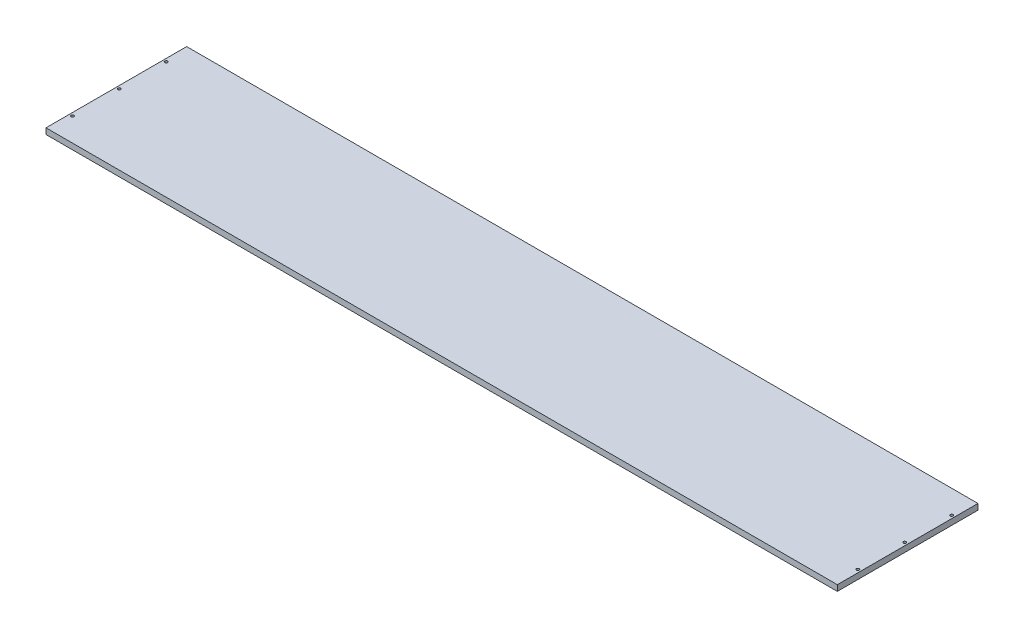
ISO-10303-21;
HEADER;
FILE_DESCRIPTION(('STEP AP214'),'2;1');
FILE_NAME('part.step','',(''),(''),'','','');
FILE_SCHEMA(('AUTOMOTIVE_DESIGN { 1 0 10303 214 1 1 1 1 }'));
ENDSEC;
DATA;
#1=APPLICATION_CONTEXT('core data for automotive mechanical design processes');
#2=APPLICATION_PROTOCOL_DEFINITION('international standard','automotive_design',2000,#1);
#3=PRODUCT_CONTEXT('',#1,'mechanical');
#4=PRODUCT('Part','Part','',(#3));
#5=PRODUCT_RELATED_PRODUCT_CATEGORY('part','',(#4));
#6=PRODUCT_DEFINITION_FORMATION('','',#4);
#7=PRODUCT_DEFINITION_CONTEXT('part definition',#1,'design');
#8=PRODUCT_DEFINITION('design','',#6,#7);
#9=PRODUCT_DEFINITION_SHAPE('','',#8);
#10=(LENGTH_UNIT() NAMED_UNIT(*) SI_UNIT(.MILLI.,.METRE.));
#11=(NAMED_UNIT(*) PLANE_ANGLE_UNIT() SI_UNIT($,.RADIAN.));
#12=(NAMED_UNIT(*) SI_UNIT($,.STERADIAN.) SOLID_ANGLE_UNIT());
#13=UNCERTAINTY_MEASURE_WITH_UNIT(LENGTH_MEASURE(1.E-05),#10,'distance_accuracy_value','');
#14=(GEOMETRIC_REPRESENTATION_CONTEXT(3) GLOBAL_UNCERTAINTY_ASSIGNED_CONTEXT((#13)) GLOBAL_UNIT_ASSIGNED_CONTEXT((#10,
#11,#12)) REPRESENTATION_CONTEXT('',''));
#15=CARTESIAN_POINT('',(0.,0.,0.));
#16=DIRECTION('',(0.,0.,1.));
#17=DIRECTION('',(1.,0.,0.));
#18=AXIS2_PLACEMENT_3D('',#15,#16,#17);
#19=CARTESIAN_POINT('',(428.625,6.35,76.2));
#20=DIRECTION('',(-1.,0.,0.));
#21=DIRECTION('',(0.,0.,1.));
#22=AXIS2_PLACEMENT_3D('',#19,#20,#21);
#23=PLANE('',#22);
#24=DIRECTION('',(0.,0.,-1.));
#25=VECTOR('',#24,1.);
#26=CARTESIAN_POINT('',(428.625,0.,76.2));
#27=LINE('',#26,#25);
#28=CARTESIAN_POINT('',(428.625,0.,76.2));
#29=VERTEX_POINT('',#28);
#30=CARTESIAN_POINT('',(428.625,0.,-76.2));
#31=VERTEX_POINT('',#30);
#32=EDGE_CURVE('E100',#29,#31,#27,.T.);
#33=ORIENTED_EDGE('',*,*,#32,.T.);
#34=DIRECTION('',(0.,-1.,0.));
#35=VECTOR('',#34,1.);
#36=CARTESIAN_POINT('',(428.625,6.35,-76.2));
#37=LINE('',#36,#35);
#38=CARTESIAN_POINT('',(428.625,6.35,-76.2));
#39=VERTEX_POINT('',#38);
#40=EDGE_CURVE('E11',#39,#31,#37,.T.);
#41=ORIENTED_EDGE('',*,*,#40,.F.);
#42=DIRECTION('',(0.,0.,-1.));
#43=VECTOR('',#42,1.);
#44=CARTESIAN_POINT('',(428.625,6.35,76.2));
#45=LINE('',#44,#43);
#46=CARTESIAN_POINT('',(428.625,6.35,76.2));
#47=VERTEX_POINT('',#46);
#48=EDGE_CURVE('E88',#47,#39,#45,.T.);
#49=ORIENTED_EDGE('',*,*,#48,.F.);
#50=DIRECTION('',(0.,-1.,0.));
#51=VECTOR('',#50,1.);
#52=CARTESIAN_POINT('',(428.625,6.35,76.2));
#53=LINE('',#52,#51);
#54=EDGE_CURVE('E96',#47,#29,#53,.T.);
#55=ORIENTED_EDGE('',*,*,#54,.T.);
#56=EDGE_LOOP('',(#33,#41,#49,#55));
#57=FACE_BOUND('',#56,.T.);
#58=ADVANCED_FACE('F37',(#57),#23,.F.);
#59=CARTESIAN_POINT('',(-428.625,6.35,-76.2));
#60=DIRECTION('',(0.,0.,1.));
#61=DIRECTION('',(1.,0.,0.));
#62=AXIS2_PLACEMENT_3D('',#59,#60,#61);
#63=PLANE('',#62);
#64=DIRECTION('',(-1.,0.,0.));
#65=VECTOR('',#64,1.);
#66=CARTESIAN_POINT('',(-428.625,0.,-76.2));
#67=LINE('',#66,#65);
#68=CARTESIAN_POINT('',(-428.625,0.,-76.2));
#69=VERTEX_POINT('',#68);
#70=EDGE_CURVE('E92',#31,#69,#67,.T.);
#71=ORIENTED_EDGE('',*,*,#70,.T.);
#72=DIRECTION('',(0.,-1.,0.));
#73=VECTOR('',#72,1.);
#74=CARTESIAN_POINT('',(-428.625,6.35,-76.2));
#75=LINE('',#74,#73);
#76=CARTESIAN_POINT('',(-428.625,6.35,-76.2));
#77=VERTEX_POINT('',#76);
#78=EDGE_CURVE('E45',#77,#69,#75,.T.);
#79=ORIENTED_EDGE('',*,*,#78,.F.);
#80=DIRECTION('',(-1.,0.,0.));
#81=VECTOR('',#80,1.);
#82=CARTESIAN_POINT('',(-428.625,6.35,-76.2));
#83=LINE('',#82,#81);
#84=EDGE_CURVE('E83',#39,#77,#83,.T.);
#85=ORIENTED_EDGE('',*,*,#84,.F.);
#86=ORIENTED_EDGE('',*,*,#40,.T.);
#87=EDGE_LOOP('',(#71,#79,#85,#86));
#88=FACE_BOUND('',#87,.T.);
#89=ADVANCED_FACE('F91',(#88),#63,.F.);
#90=CARTESIAN_POINT('',(-428.625,6.35,76.2));
#91=DIRECTION('',(1.,0.,0.));
#92=DIRECTION('',(0.,0.,-1.));
#93=AXIS2_PLACEMENT_3D('',#90,#91,#92);
#94=PLANE('',#93);
#95=DIRECTION('',(0.,0.,1.));
#96=VECTOR('',#95,1.);
#97=CARTESIAN_POINT('',(-428.625,0.,76.2));
#98=LINE('',#97,#96);
#99=CARTESIAN_POINT('',(-428.625,0.,76.2));
#100=VERTEX_POINT('',#99);
#101=EDGE_CURVE('E70',#69,#100,#98,.T.);
#102=ORIENTED_EDGE('',*,*,#101,.T.);
#103=DIRECTION('',(0.,-1.,0.));
#104=VECTOR('',#103,1.);
#105=CARTESIAN_POINT('',(-428.625,6.35,76.2));
#106=LINE('',#105,#104);
#107=CARTESIAN_POINT('',(-428.625,6.35,76.2));
#108=VERTEX_POINT('',#107);
#109=EDGE_CURVE('E93',#108,#100,#106,.T.);
#110=ORIENTED_EDGE('',*,*,#109,.F.);
#111=DIRECTION('',(0.,0.,1.));
#112=VECTOR('',#111,1.);
#113=CARTESIAN_POINT('',(-428.625,6.35,76.2));
#114=LINE('',#113,#112);
#115=EDGE_CURVE('E86',#77,#108,#114,.T.);
#116=ORIENTED_EDGE('',*,*,#115,.F.);
#117=ORIENTED_EDGE('',*,*,#78,.T.);
#118=EDGE_LOOP('',(#102,#110,#116,#117));
#119=FACE_BOUND('',#118,.T.);
#120=ADVANCED_FACE('F94',(#119),#94,.F.);
#121=CARTESIAN_POINT('',(-428.625,6.35,76.2));
#122=DIRECTION('',(0.,0.,-1.));
#123=DIRECTION('',(-1.,0.,0.));
#124=AXIS2_PLACEMENT_3D('',#121,#122,#123);
#125=PLANE('',#124);
#126=DIRECTION('',(1.,0.,0.));
#127=VECTOR('',#126,1.);
#128=CARTESIAN_POINT('',(-428.625,0.,76.2));
#129=LINE('',#128,#127);
#130=EDGE_CURVE('E76',#100,#29,#129,.T.);
#131=ORIENTED_EDGE('',*,*,#130,.T.);
#132=ORIENTED_EDGE('',*,*,#54,.F.);
#133=DIRECTION('',(1.,0.,0.));
#134=VECTOR('',#133,1.);
#135=CARTESIAN_POINT('',(-428.625,6.35,76.2));
#136=LINE('',#135,#134);
#137=EDGE_CURVE('E53',#108,#47,#136,.T.);
#138=ORIENTED_EDGE('',*,*,#137,.F.);
#139=ORIENTED_EDGE('',*,*,#109,.T.);
#140=EDGE_LOOP('',(#131,#132,#138,#139));
#141=FACE_BOUND('',#140,.T.);
#142=ADVANCED_FACE('F108',(#141),#125,.F.);
#143=CARTESIAN_POINT('',(0.,6.35,0.));
#144=DIRECTION('',(0.,-1.,0.));
#145=DIRECTION('',(0.,0.,-1.));
#146=AXIS2_PLACEMENT_3D('',#143,#144,#145);
#147=PLANE('',#146);
#148=CARTESIAN_POINT('',(425.45,6.35,0.));
#149=DIRECTION('',(0.,1.,0.));
#150=DIRECTION('',(0.,0.,1.));
#151=AXIS2_PLACEMENT_3D('',#148,#149,#150);
#152=CIRCLE('',#151,1.52399999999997);
#153=CARTESIAN_POINT('',(425.45,6.35,1.52399999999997));
#154=VERTEX_POINT('',#153);
#155=EDGE_CURVE('E146',#154,#154,#152,.T.);
#156=ORIENTED_EDGE('',*,*,#155,.F.);
#157=EDGE_LOOP('',(#156));
#158=FACE_BOUND('',#157,.T.);
#159=CARTESIAN_POINT('',(425.45,6.35,-50.8));
#160=DIRECTION('',(0.,1.,0.));
#161=DIRECTION('',(0.,0.,1.));
#162=AXIS2_PLACEMENT_3D('',#159,#160,#161);
#163=CIRCLE('',#162,1.52399999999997);
#164=CARTESIAN_POINT('',(425.45,6.35,-49.276));
#165=VERTEX_POINT('',#164);
#166=EDGE_CURVE('E140',#165,#165,#163,.T.);
#167=ORIENTED_EDGE('',*,*,#166,.F.);
#168=EDGE_LOOP('',(#167));
#169=FACE_BOUND('',#168,.T.);
#170=CARTESIAN_POINT('',(425.45,6.35,50.8));
#171=DIRECTION('',(0.,1.,0.));
#172=DIRECTION('',(0.,0.,1.));
#173=AXIS2_PLACEMENT_3D('',#170,#171,#172);
#174=CIRCLE('',#173,1.52399999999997);
#175=CARTESIAN_POINT('',(425.45,6.35,52.324));
#176=VERTEX_POINT('',#175);
#177=EDGE_CURVE('E134',#176,#176,#174,.T.);
#178=ORIENTED_EDGE('',*,*,#177,.F.);
#179=EDGE_LOOP('',(#178));
#180=FACE_BOUND('',#179,.T.);
#181=CARTESIAN_POINT('',(-425.45,6.35,0.));
#182=DIRECTION('',(0.,1.,0.));
#183=DIRECTION('',(0.,0.,1.));
#184=AXIS2_PLACEMENT_3D('',#181,#182,#183);
#185=CIRCLE('',#184,1.52399999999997);
#186=CARTESIAN_POINT('',(-425.45,6.35,1.52399999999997));
#187=VERTEX_POINT('',#186);
#188=EDGE_CURVE('E128',#187,#187,#185,.T.);
#189=ORIENTED_EDGE('',*,*,#188,.F.);
#190=EDGE_LOOP('',(#189));
#191=FACE_BOUND('',#190,.T.);
#192=CARTESIAN_POINT('',(-425.45,6.35,50.8));
#193=DIRECTION('',(0.,1.,0.));
#194=DIRECTION('',(0.,0.,1.));
#195=AXIS2_PLACEMENT_3D('',#192,#193,#194);
#196=CIRCLE('',#195,1.52399999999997);
#197=CARTESIAN_POINT('',(-425.45,6.35,52.324));
#198=VERTEX_POINT('',#197);
#199=EDGE_CURVE('E122',#198,#198,#196,.T.);
#200=ORIENTED_EDGE('',*,*,#199,.F.);
#201=EDGE_LOOP('',(#200));
#202=FACE_BOUND('',#201,.T.);
#203=CARTESIAN_POINT('',(-425.45,6.35,-50.8));
#204=DIRECTION('',(0.,1.,0.));
#205=DIRECTION('',(0.,0.,1.));
#206=AXIS2_PLACEMENT_3D('',#203,#204,#205);
#207=CIRCLE('',#206,1.52399999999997);
#208=CARTESIAN_POINT('',(-425.45,6.35,-49.276));
#209=VERTEX_POINT('',#208);
#210=EDGE_CURVE('E116',#209,#209,#207,.T.);
#211=ORIENTED_EDGE('',*,*,#210,.F.);
#212=EDGE_LOOP('',(#211));
#213=FACE_BOUND('',#212,.T.);
#214=ORIENTED_EDGE('',*,*,#48,.T.);
#215=ORIENTED_EDGE('',*,*,#84,.T.);
#216=ORIENTED_EDGE('',*,*,#115,.T.);
#217=ORIENTED_EDGE('',*,*,#137,.T.);
#218=EDGE_LOOP('',(#214,#215,#216,#217));
#219=FACE_BOUND('',#218,.T.);
#220=ADVANCED_FACE('F84',(#158,#169,#180,#191,#202,#213,#219),#147,.F.);
#221=CARTESIAN_POINT('',(0.,0.,0.));
#222=DIRECTION('',(0.,-1.,0.));
#223=DIRECTION('',(0.,0.,-1.));
#224=AXIS2_PLACEMENT_3D('',#221,#222,#223);
#225=PLANE('',#224);
#226=CARTESIAN_POINT('',(425.45,0.,0.));
#227=DIRECTION('',(0.,1.,0.));
#228=DIRECTION('',(0.,0.,1.));
#229=AXIS2_PLACEMENT_3D('',#226,#227,#228);
#230=CIRCLE('',#229,1.52400000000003);
#231=CARTESIAN_POINT('',(425.45,0.,1.52400000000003));
#232=VERTEX_POINT('',#231);
#233=EDGE_CURVE('E143',#232,#232,#230,.T.);
#234=ORIENTED_EDGE('',*,*,#233,.T.);
#235=EDGE_LOOP('',(#234));
#236=FACE_BOUND('',#235,.T.);
#237=CARTESIAN_POINT('',(425.45,0.,-50.8));
#238=DIRECTION('',(0.,1.,0.));
#239=DIRECTION('',(0.,0.,1.));
#240=AXIS2_PLACEMENT_3D('',#237,#238,#239);
#241=CIRCLE('',#240,1.52400000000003);
#242=CARTESIAN_POINT('',(425.45,0.,-49.276));
#243=VERTEX_POINT('',#242);
#244=EDGE_CURVE('E137',#243,#243,#241,.T.);
#245=ORIENTED_EDGE('',*,*,#244,.T.);
#246=EDGE_LOOP('',(#245));
#247=FACE_BOUND('',#246,.T.);
#248=CARTESIAN_POINT('',(425.45,0.,50.8));
#249=DIRECTION('',(0.,1.,0.));
#250=DIRECTION('',(0.,0.,1.));
#251=AXIS2_PLACEMENT_3D('',#248,#249,#250);
#252=CIRCLE('',#251,1.52400000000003);
#253=CARTESIAN_POINT('',(425.45,0.,52.324));
#254=VERTEX_POINT('',#253);
#255=EDGE_CURVE('E131',#254,#254,#252,.T.);
#256=ORIENTED_EDGE('',*,*,#255,.T.);
#257=EDGE_LOOP('',(#256));
#258=FACE_BOUND('',#257,.T.);
#259=CARTESIAN_POINT('',(-425.45,0.,0.));
#260=DIRECTION('',(0.,1.,0.));
#261=DIRECTION('',(0.,0.,1.));
#262=AXIS2_PLACEMENT_3D('',#259,#260,#261);
#263=CIRCLE('',#262,1.52400000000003);
#264=CARTESIAN_POINT('',(-425.45,0.,1.52400000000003));
#265=VERTEX_POINT('',#264);
#266=EDGE_CURVE('E125',#265,#265,#263,.T.);
#267=ORIENTED_EDGE('',*,*,#266,.T.);
#268=EDGE_LOOP('',(#267));
#269=FACE_BOUND('',#268,.T.);
#270=CARTESIAN_POINT('',(-425.45,0.,50.8));
#271=DIRECTION('',(0.,1.,0.));
#272=DIRECTION('',(0.,0.,1.));
#273=AXIS2_PLACEMENT_3D('',#270,#271,#272);
#274=CIRCLE('',#273,1.52400000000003);
#275=CARTESIAN_POINT('',(-425.45,0.,52.324));
#276=VERTEX_POINT('',#275);
#277=EDGE_CURVE('E119',#276,#276,#274,.T.);
#278=ORIENTED_EDGE('',*,*,#277,.T.);
#279=EDGE_LOOP('',(#278));
#280=FACE_BOUND('',#279,.T.);
#281=CARTESIAN_POINT('',(-425.45,0.,-50.8));
#282=DIRECTION('',(0.,1.,0.));
#283=DIRECTION('',(0.,0.,1.));
#284=AXIS2_PLACEMENT_3D('',#281,#282,#283);
#285=CIRCLE('',#284,1.52400000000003);
#286=CARTESIAN_POINT('',(-425.45,0.,-49.276));
#287=VERTEX_POINT('',#286);
#288=EDGE_CURVE('E103',#287,#287,#285,.T.);
#289=ORIENTED_EDGE('',*,*,#288,.T.);
#290=EDGE_LOOP('',(#289));
#291=FACE_BOUND('',#290,.T.);
#292=ORIENTED_EDGE('',*,*,#32,.F.);
#293=ORIENTED_EDGE('',*,*,#130,.F.);
#294=ORIENTED_EDGE('',*,*,#101,.F.);
#295=ORIENTED_EDGE('',*,*,#70,.F.);
#296=EDGE_LOOP('',(#292,#293,#294,#295));
#297=FACE_BOUND('',#296,.T.);
#298=ADVANCED_FACE('F111',(#236,#247,#258,#269,#280,#291,#297),#225,.T.);
#299=CARTESIAN_POINT('',(-425.45,6.35,-50.8));
#300=DIRECTION('',(0.,1.,0.));
#301=DIRECTION('',(0.,0.,1.));
#302=AXIS2_PLACEMENT_3D('',#299,#300,#301);
#303=CYLINDRICAL_SURFACE('',#302,1.524);
#304=ORIENTED_EDGE('',*,*,#288,.F.);
#305=EDGE_LOOP('',(#304));
#306=FACE_BOUND('',#305,.T.);
#307=ORIENTED_EDGE('',*,*,#210,.T.);
#308=EDGE_LOOP('',(#307));
#309=FACE_BOUND('',#308,.T.);
#310=ADVANCED_FACE('F165',(#306,#309),#303,.F.);
#311=CARTESIAN_POINT('',(-425.45,6.35,50.8));
#312=DIRECTION('',(0.,1.,0.));
#313=DIRECTION('',(0.,0.,1.));
#314=AXIS2_PLACEMENT_3D('',#311,#312,#313);
#315=CYLINDRICAL_SURFACE('',#314,1.524);
#316=ORIENTED_EDGE('',*,*,#277,.F.);
#317=EDGE_LOOP('',(#316));
#318=FACE_BOUND('',#317,.T.);
#319=ORIENTED_EDGE('',*,*,#199,.T.);
#320=EDGE_LOOP('',(#319));
#321=FACE_BOUND('',#320,.T.);
#322=ADVANCED_FACE('F167',(#318,#321),#315,.F.);
#323=CARTESIAN_POINT('',(-425.45,6.35,0.));
#324=DIRECTION('',(0.,1.,0.));
#325=DIRECTION('',(0.,0.,1.));
#326=AXIS2_PLACEMENT_3D('',#323,#324,#325);
#327=CYLINDRICAL_SURFACE('',#326,1.524);
#328=ORIENTED_EDGE('',*,*,#266,.F.);
#329=EDGE_LOOP('',(#328));
#330=FACE_BOUND('',#329,.T.);
#331=ORIENTED_EDGE('',*,*,#188,.T.);
#332=EDGE_LOOP('',(#331));
#333=FACE_BOUND('',#332,.T.);
#334=ADVANCED_FACE('F174',(#330,#333),#327,.F.);
#335=CARTESIAN_POINT('',(425.45,6.35,50.8));
#336=DIRECTION('',(0.,1.,0.));
#337=DIRECTION('',(0.,0.,1.));
#338=AXIS2_PLACEMENT_3D('',#335,#336,#337);
#339=CYLINDRICAL_SURFACE('',#338,1.524);
#340=ORIENTED_EDGE('',*,*,#255,.F.);
#341=EDGE_LOOP('',(#340));
#342=FACE_BOUND('',#341,.T.);
#343=ORIENTED_EDGE('',*,*,#177,.T.);
#344=EDGE_LOOP('',(#343));
#345=FACE_BOUND('',#344,.T.);
#346=ADVANCED_FACE('F224',(#342,#345),#339,.F.);
#347=CARTESIAN_POINT('',(425.45,6.35,-50.8));
#348=DIRECTION('',(0.,1.,0.));
#349=DIRECTION('',(0.,0.,1.));
#350=AXIS2_PLACEMENT_3D('',#347,#348,#349);
#351=CYLINDRICAL_SURFACE('',#350,1.524);
#352=ORIENTED_EDGE('',*,*,#244,.F.);
#353=EDGE_LOOP('',(#352));
#354=FACE_BOUND('',#353,.T.);
#355=ORIENTED_EDGE('',*,*,#166,.T.);
#356=EDGE_LOOP('',(#355));
#357=FACE_BOUND('',#356,.T.);
#358=ADVANCED_FACE('F235',(#354,#357),#351,.F.);
#359=CARTESIAN_POINT('',(425.45,6.35,0.));
#360=DIRECTION('',(0.,1.,0.));
#361=DIRECTION('',(0.,0.,1.));
#362=AXIS2_PLACEMENT_3D('',#359,#360,#361);
#363=CYLINDRICAL_SURFACE('',#362,1.524);
#364=ORIENTED_EDGE('',*,*,#233,.F.);
#365=EDGE_LOOP('',(#364));
#366=FACE_BOUND('',#365,.T.);
#367=ORIENTED_EDGE('',*,*,#155,.T.);
#368=EDGE_LOOP('',(#367));
#369=FACE_BOUND('',#368,.T.);
#370=ADVANCED_FACE('F150',(#366,#369),#363,.F.);
#371=CLOSED_SHELL('',(#58,#89,#120,#142,#220,#298,#310,#322,#334,#346,#358,#370));
#372=MANIFOLD_SOLID_BREP('B2',#371);
#373=ADVANCED_BREP_SHAPE_REPRESENTATION('',(#18,#372),#14);
#374=SHAPE_DEFINITION_REPRESENTATION(#9,#373);
ENDSEC;
END-ISO-10303-21;
